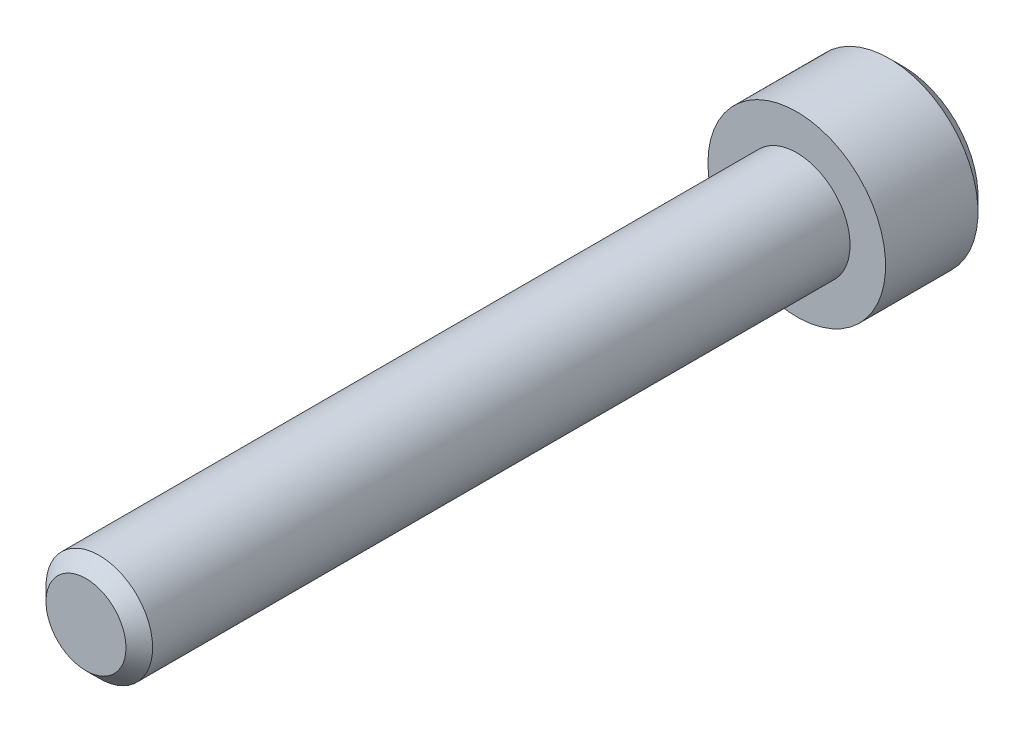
ISO-10303-21;
HEADER;
FILE_DESCRIPTION(('STEP AP214'),'2;1');
FILE_NAME('part.step','',(''),(''),'','','');
FILE_SCHEMA(('AUTOMOTIVE_DESIGN { 1 0 10303 214 1 1 1 1 }'));
ENDSEC;
DATA;
#1=APPLICATION_CONTEXT('core data for automotive mechanical design processes');
#2=APPLICATION_PROTOCOL_DEFINITION('international standard','automotive_design',2000,#1);
#3=PRODUCT_CONTEXT('',#1,'mechanical');
#4=PRODUCT('Part','Part','',(#3));
#5=PRODUCT_RELATED_PRODUCT_CATEGORY('part','',(#4));
#6=PRODUCT_DEFINITION_FORMATION('','',#4);
#7=PRODUCT_DEFINITION_CONTEXT('part definition',#1,'design');
#8=PRODUCT_DEFINITION('design','',#6,#7);
#9=PRODUCT_DEFINITION_SHAPE('','',#8);
#10=(LENGTH_UNIT() NAMED_UNIT(*) SI_UNIT(.MILLI.,.METRE.));
#11=(NAMED_UNIT(*) PLANE_ANGLE_UNIT() SI_UNIT($,.RADIAN.));
#12=(NAMED_UNIT(*) SI_UNIT($,.STERADIAN.) SOLID_ANGLE_UNIT());
#13=UNCERTAINTY_MEASURE_WITH_UNIT(LENGTH_MEASURE(1.E-05),#10,'distance_accuracy_value','');
#14=(GEOMETRIC_REPRESENTATION_CONTEXT(3) GLOBAL_UNCERTAINTY_ASSIGNED_CONTEXT((#13)) GLOBAL_UNIT_ASSIGNED_CONTEXT((#10,
#11,#12)) REPRESENTATION_CONTEXT('',''));
#15=CARTESIAN_POINT('',(0.,0.,0.));
#16=DIRECTION('',(0.,0.,1.));
#17=DIRECTION('',(1.,0.,0.));
#18=AXIS2_PLACEMENT_3D('',#15,#16,#17);
#19=CARTESIAN_POINT('',(10.0000080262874,-60.435,-91.));
#20=DIRECTION('',(0.,0.,-1.));
#21=DIRECTION('',(-1.,0.,0.));
#22=AXIS2_PLACEMENT_3D('',#19,#20,#21);
#23=PLANE('',#22);
#24=DIRECTION('',(-0.5,-0.866025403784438,0.));
#25=VECTOR('',#24,1.);
#26=CARTESIAN_POINT('',(12.8867593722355,-60.435,-91.));
#27=LINE('',#26,#25);
#28=CARTESIAN_POINT('',(12.8867593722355,-60.435,-91.));
#29=VERTEX_POINT('',#28);
#30=CARTESIAN_POINT('',(11.4433836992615,-62.935,-91.));
#31=VERTEX_POINT('',#30);
#32=EDGE_CURVE('E291',#29,#31,#27,.T.);
#33=ORIENTED_EDGE('',*,*,#32,.F.);
#34=DIRECTION('',(0.5,-0.866025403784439,0.));
#35=VECTOR('',#34,1.);
#36=CARTESIAN_POINT('',(11.4433836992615,-57.935,-91.));
#37=LINE('',#36,#35);
#38=CARTESIAN_POINT('',(11.4433836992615,-57.935,-91.));
#39=VERTEX_POINT('',#38);
#40=EDGE_CURVE('E88',#39,#29,#37,.T.);
#41=ORIENTED_EDGE('',*,*,#40,.F.);
#42=DIRECTION('',(1.,0.,0.));
#43=VECTOR('',#42,1.);
#44=CARTESIAN_POINT('',(8.55663235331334,-57.935,-91.));
#45=LINE('',#44,#43);
#46=CARTESIAN_POINT('',(8.55663235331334,-57.935,-91.));
#47=VERTEX_POINT('',#46);
#48=EDGE_CURVE('E31',#47,#39,#45,.T.);
#49=ORIENTED_EDGE('',*,*,#48,.F.);
#50=DIRECTION('',(0.5,0.866025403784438,0.));
#51=VECTOR('',#50,1.);
#52=CARTESIAN_POINT('',(7.11325668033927,-60.435,-91.));
#53=LINE('',#52,#51);
#54=CARTESIAN_POINT('',(7.11325668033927,-60.435,-91.));
#55=VERTEX_POINT('',#54);
#56=EDGE_CURVE('E66',#55,#47,#53,.T.);
#57=ORIENTED_EDGE('',*,*,#56,.F.);
#58=DIRECTION('',(-0.5,0.86602540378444,0.));
#59=VECTOR('',#58,1.);
#60=CARTESIAN_POINT('',(8.55663235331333,-62.935,-91.));
#61=LINE('',#60,#59);
#62=CARTESIAN_POINT('',(8.55663235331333,-62.935,-91.));
#63=VERTEX_POINT('',#62);
#64=EDGE_CURVE('E76',#63,#55,#61,.T.);
#65=ORIENTED_EDGE('',*,*,#64,.F.);
#66=DIRECTION('',(-1.,0.,0.));
#67=VECTOR('',#66,1.);
#68=CARTESIAN_POINT('',(11.4433836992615,-62.935,-91.));
#69=LINE('',#68,#67);
#70=EDGE_CURVE('E82',#31,#63,#69,.T.);
#71=ORIENTED_EDGE('',*,*,#70,.F.);
#72=EDGE_LOOP('',(#33,#41,#49,#57,#65,#71));
#73=FACE_BOUND('',#72,.T.);
#74=CARTESIAN_POINT('',(10.0000080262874,-60.435,-91.));
#75=DIRECTION('',(0.,0.,-1.));
#76=DIRECTION('',(-1.,0.,0.));
#77=AXIS2_PLACEMENT_3D('',#74,#75,#76);
#78=CIRCLE('',#77,4.2);
#79=CARTESIAN_POINT('',(5.8000080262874,-60.435,-91.));
#80=VERTEX_POINT('',#79);
#81=EDGE_CURVE('E110',#80,#80,#78,.T.);
#82=ORIENTED_EDGE('',*,*,#81,.T.);
#83=EDGE_LOOP('',(#82));
#84=FACE_BOUND('',#83,.T.);
#85=ADVANCED_FACE('F16',(#73,#84),#23,.T.);
#86=CARTESIAN_POINT('',(10.0000080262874,-60.435,-85.));
#87=DIRECTION('',(0.,0.,1.));
#88=DIRECTION('',(1.,0.,0.));
#89=AXIS2_PLACEMENT_3D('',#86,#87,#88);
#90=PLANE('',#89);
#91=CARTESIAN_POINT('',(10.0000080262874,-60.435,-85.));
#92=DIRECTION('',(0.,0.,1.));
#93=DIRECTION('',(1.,0.,0.));
#94=AXIS2_PLACEMENT_3D('',#91,#92,#93);
#95=CIRCLE('',#94,3.);
#96=CARTESIAN_POINT('',(13.0000080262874,-60.435,-85.));
#97=VERTEX_POINT('',#96);
#98=EDGE_CURVE('E113',#97,#97,#95,.T.);
#99=ORIENTED_EDGE('',*,*,#98,.F.);
#100=EDGE_LOOP('',(#99));
#101=FACE_BOUND('',#100,.T.);
#102=CARTESIAN_POINT('',(10.0000080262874,-60.435,-85.));
#103=DIRECTION('',(0.,0.,-1.));
#104=DIRECTION('',(-1.,0.,0.));
#105=AXIS2_PLACEMENT_3D('',#102,#103,#104);
#106=CIRCLE('',#105,5.);
#107=CARTESIAN_POINT('',(5.0000080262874,-60.435,-85.));
#108=VERTEX_POINT('',#107);
#109=EDGE_CURVE('E102',#108,#108,#106,.T.);
#110=ORIENTED_EDGE('',*,*,#109,.F.);
#111=EDGE_LOOP('',(#110));
#112=FACE_BOUND('',#111,.T.);
#113=ADVANCED_FACE('F132',(#101,#112),#90,.T.);
#114=CARTESIAN_POINT('',(10.0000080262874,-60.435,-85.));
#115=DIRECTION('',(0.,0.,-1.));
#116=DIRECTION('',(-1.,0.,0.));
#117=AXIS2_PLACEMENT_3D('',#114,#115,#116);
#118=CYLINDRICAL_SURFACE('',#117,5.);
#119=CARTESIAN_POINT('',(10.0000080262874,-60.435,-90.2));
#120=DIRECTION('',(0.,0.,-1.));
#121=DIRECTION('',(-1.,0.,0.));
#122=AXIS2_PLACEMENT_3D('',#119,#120,#121);
#123=CIRCLE('',#122,5.);
#124=CARTESIAN_POINT('',(5.0000080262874,-60.435,-90.2));
#125=VERTEX_POINT('',#124);
#126=EDGE_CURVE('E107',#125,#125,#123,.F.);
#127=ORIENTED_EDGE('',*,*,#126,.T.);
#128=EDGE_LOOP('',(#127));
#129=FACE_BOUND('',#128,.T.);
#130=ORIENTED_EDGE('',*,*,#109,.T.);
#131=EDGE_LOOP('',(#130));
#132=FACE_BOUND('',#131,.T.);
#133=ADVANCED_FACE('F137',(#129,#132),#118,.T.);
#134=CARTESIAN_POINT('',(10.0000080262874,-60.435,-90.2));
#135=DIRECTION('',(0.,0.,1.));
#136=DIRECTION('',(1.,0.,0.));
#137=AXIS2_PLACEMENT_3D('',#134,#135,#136);
#138=CONICAL_SURFACE('',#137,5.,0.785398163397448);
#139=ORIENTED_EDGE('',*,*,#81,.F.);
#140=EDGE_LOOP('',(#139));
#141=FACE_BOUND('',#140,.T.);
#142=ORIENTED_EDGE('',*,*,#126,.F.);
#143=EDGE_LOOP('',(#142));
#144=FACE_BOUND('',#143,.T.);
#145=ADVANCED_FACE('F143',(#141,#144),#138,.T.);
#146=CARTESIAN_POINT('',(12.8867593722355,-60.435,-88.));
#147=DIRECTION('',(0.866025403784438,-0.5,0.));
#148=DIRECTION('',(0.5,0.866025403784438,0.));
#149=AXIS2_PLACEMENT_3D('',#146,#147,#148);
#150=PLANE('',#149);
#151=ORIENTED_EDGE('',*,*,#32,.T.);
#152=DIRECTION('',(0.,0.,-1.));
#153=VECTOR('',#152,1.);
#154=CARTESIAN_POINT('',(11.4433836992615,-62.935,-88.));
#155=LINE('',#154,#153);
#156=CARTESIAN_POINT('',(11.4433836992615,-62.935,-88.));
#157=VERTEX_POINT('',#156);
#158=EDGE_CURVE('E100',#157,#31,#155,.T.);
#159=ORIENTED_EDGE('',*,*,#158,.F.);
#160=DIRECTION('',(-0.5,-0.866025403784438,0.));
#161=VECTOR('',#160,1.);
#162=CARTESIAN_POINT('',(12.8867593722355,-60.435,-88.));
#163=LINE('',#162,#161);
#164=CARTESIAN_POINT('',(12.8867593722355,-60.435,-88.));
#165=VERTEX_POINT('',#164);
#166=EDGE_CURVE('E94',#165,#157,#163,.T.);
#167=ORIENTED_EDGE('',*,*,#166,.F.);
#168=DIRECTION('',(0.,0.,-1.));
#169=VECTOR('',#168,1.);
#170=CARTESIAN_POINT('',(12.8867593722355,-60.435,-88.));
#171=LINE('',#170,#169);
#172=EDGE_CURVE('E97',#165,#29,#171,.T.);
#173=ORIENTED_EDGE('',*,*,#172,.T.);
#174=EDGE_LOOP('',(#151,#159,#167,#173));
#175=FACE_BOUND('',#174,.T.);
#176=ADVANCED_FACE('F146',(#175),#150,.F.);
#177=CARTESIAN_POINT('',(11.4433836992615,-62.935,-88.));
#178=DIRECTION('',(0.,-1.,0.));
#179=DIRECTION('',(1.,0.,0.));
#180=AXIS2_PLACEMENT_3D('',#177,#178,#179);
#181=PLANE('',#180);
#182=ORIENTED_EDGE('',*,*,#70,.T.);
#183=DIRECTION('',(0.,0.,-1.));
#184=VECTOR('',#183,1.);
#185=CARTESIAN_POINT('',(8.55663235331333,-62.935,-88.));
#186=LINE('',#185,#184);
#187=CARTESIAN_POINT('',(8.55663235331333,-62.935,-88.));
#188=VERTEX_POINT('',#187);
#189=EDGE_CURVE('E72',#188,#63,#186,.T.);
#190=ORIENTED_EDGE('',*,*,#189,.F.);
#191=DIRECTION('',(-1.,0.,0.));
#192=VECTOR('',#191,1.);
#193=CARTESIAN_POINT('',(11.4433836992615,-62.935,-88.));
#194=LINE('',#193,#192);
#195=EDGE_CURVE('E288',#157,#188,#194,.T.);
#196=ORIENTED_EDGE('',*,*,#195,.F.);
#197=ORIENTED_EDGE('',*,*,#158,.T.);
#198=EDGE_LOOP('',(#182,#190,#196,#197));
#199=FACE_BOUND('',#198,.T.);
#200=ADVANCED_FACE('F151',(#199),#181,.F.);
#201=CARTESIAN_POINT('',(8.55663235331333,-62.935,-88.));
#202=DIRECTION('',(-0.86602540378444,-0.5,0.));
#203=DIRECTION('',(0.5,-0.86602540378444,0.));
#204=AXIS2_PLACEMENT_3D('',#201,#202,#203);
#205=PLANE('',#204);
#206=ORIENTED_EDGE('',*,*,#64,.T.);
#207=DIRECTION('',(0.,0.,-1.));
#208=VECTOR('',#207,1.);
#209=CARTESIAN_POINT('',(7.11325668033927,-60.435,-88.));
#210=LINE('',#209,#208);
#211=CARTESIAN_POINT('',(7.11325668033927,-60.435,-88.));
#212=VERTEX_POINT('',#211);
#213=EDGE_CURVE('E61',#212,#55,#210,.T.);
#214=ORIENTED_EDGE('',*,*,#213,.F.);
#215=DIRECTION('',(-0.5,0.86602540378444,0.));
#216=VECTOR('',#215,1.);
#217=CARTESIAN_POINT('',(8.55663235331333,-62.935,-88.));
#218=LINE('',#217,#216);
#219=EDGE_CURVE('E294',#188,#212,#218,.T.);
#220=ORIENTED_EDGE('',*,*,#219,.F.);
#221=ORIENTED_EDGE('',*,*,#189,.T.);
#222=EDGE_LOOP('',(#206,#214,#220,#221));
#223=FACE_BOUND('',#222,.T.);
#224=ADVANCED_FACE('F77',(#223),#205,.F.);
#225=CARTESIAN_POINT('',(7.11325668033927,-60.435,-88.));
#226=DIRECTION('',(-0.866025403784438,0.5,0.));
#227=DIRECTION('',(-0.5,-0.866025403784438,0.));
#228=AXIS2_PLACEMENT_3D('',#225,#226,#227);
#229=PLANE('',#228);
#230=ORIENTED_EDGE('',*,*,#56,.T.);
#231=DIRECTION('',(0.,0.,-1.));
#232=VECTOR('',#231,1.);
#233=CARTESIAN_POINT('',(8.55663235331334,-57.935,-88.));
#234=LINE('',#233,#232);
#235=CARTESIAN_POINT('',(8.55663235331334,-57.935,-88.));
#236=VERTEX_POINT('',#235);
#237=EDGE_CURVE('E73',#236,#47,#234,.T.);
#238=ORIENTED_EDGE('',*,*,#237,.F.);
#239=DIRECTION('',(0.5,0.866025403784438,0.));
#240=VECTOR('',#239,1.);
#241=CARTESIAN_POINT('',(7.11325668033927,-60.435,-88.));
#242=LINE('',#241,#240);
#243=EDGE_CURVE('E69',#212,#236,#242,.T.);
#244=ORIENTED_EDGE('',*,*,#243,.F.);
#245=ORIENTED_EDGE('',*,*,#213,.T.);
#246=EDGE_LOOP('',(#230,#238,#244,#245));
#247=FACE_BOUND('',#246,.T.);
#248=ADVANCED_FACE('F63',(#247),#229,.F.);
#249=CARTESIAN_POINT('',(8.55663235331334,-57.935,-88.));
#250=DIRECTION('',(0.,1.,0.));
#251=DIRECTION('',(-1.,0.,0.));
#252=AXIS2_PLACEMENT_3D('',#249,#250,#251);
#253=PLANE('',#252);
#254=ORIENTED_EDGE('',*,*,#48,.T.);
#255=DIRECTION('',(0.,0.,-1.));
#256=VECTOR('',#255,1.);
#257=CARTESIAN_POINT('',(11.4433836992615,-57.935,-88.));
#258=LINE('',#257,#256);
#259=CARTESIAN_POINT('',(11.4433836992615,-57.935,-88.));
#260=VERTEX_POINT('',#259);
#261=EDGE_CURVE('E95',#260,#39,#258,.T.);
#262=ORIENTED_EDGE('',*,*,#261,.F.);
#263=DIRECTION('',(1.,0.,0.));
#264=VECTOR('',#263,1.);
#265=CARTESIAN_POINT('',(8.55663235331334,-57.935,-88.));
#266=LINE('',#265,#264);
#267=EDGE_CURVE('E40',#236,#260,#266,.T.);
#268=ORIENTED_EDGE('',*,*,#267,.F.);
#269=ORIENTED_EDGE('',*,*,#237,.T.);
#270=EDGE_LOOP('',(#254,#262,#268,#269));
#271=FACE_BOUND('',#270,.T.);
#272=ADVANCED_FACE('F170',(#271),#253,.F.);
#273=CARTESIAN_POINT('',(11.4433836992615,-57.935,-88.));
#274=DIRECTION('',(0.866025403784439,0.5,0.));
#275=DIRECTION('',(-0.5,0.866025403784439,0.));
#276=AXIS2_PLACEMENT_3D('',#273,#274,#275);
#277=PLANE('',#276);
#278=ORIENTED_EDGE('',*,*,#40,.T.);
#279=ORIENTED_EDGE('',*,*,#172,.F.);
#280=DIRECTION('',(0.5,-0.866025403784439,0.));
#281=VECTOR('',#280,1.);
#282=CARTESIAN_POINT('',(11.4433836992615,-57.935,-88.));
#283=LINE('',#282,#281);
#284=EDGE_CURVE('E104',#260,#165,#283,.T.);
#285=ORIENTED_EDGE('',*,*,#284,.F.);
#286=ORIENTED_EDGE('',*,*,#261,.T.);
#287=EDGE_LOOP('',(#278,#279,#285,#286));
#288=FACE_BOUND('',#287,.T.);
#289=ADVANCED_FACE('F173',(#288),#277,.F.);
#290=CARTESIAN_POINT('',(12.8867593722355,-60.435,-88.));
#291=DIRECTION('',(0.433012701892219,-0.25,0.866025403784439));
#292=DIRECTION('',(0.894427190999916,0.,-0.447213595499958));
#293=AXIS2_PLACEMENT_3D('',#290,#291,#292);
#294=PLANE('',#293);
#295=ORIENTED_EDGE('',*,*,#166,.T.);
#296=DIRECTION('',(0.447213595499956,-0.774596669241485,-0.447213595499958));
#297=VECTOR('',#296,1.);
#298=CARTESIAN_POINT('',(10.8660334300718,-61.935,-87.4226497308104));
#299=LINE('',#298,#297);
#300=CARTESIAN_POINT('',(10.0000080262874,-60.435,-86.5566243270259));
#301=VERTEX_POINT('',#300);
#302=EDGE_CURVE('E281',#301,#157,#299,.T.);
#303=ORIENTED_EDGE('',*,*,#302,.F.);
#304=DIRECTION('',(0.894427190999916,0.,-0.447213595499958));
#305=VECTOR('',#304,1.);
#306=CARTESIAN_POINT('',(11.7320588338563,-60.435,-87.4226497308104));
#307=LINE('',#306,#305);
#308=EDGE_CURVE('E284',#301,#165,#307,.T.);
#309=ORIENTED_EDGE('',*,*,#308,.T.);
#310=EDGE_LOOP('',(#295,#303,#309));
#311=FACE_BOUND('',#310,.T.);
#312=ADVANCED_FACE('F176',(#311),#294,.F.);
#313=CARTESIAN_POINT('',(11.4433836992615,-62.935,-88.));
#314=DIRECTION('',(0.,-0.5,0.866025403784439));
#315=DIRECTION('',(0.,-0.866025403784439,-0.5));
#316=AXIS2_PLACEMENT_3D('',#313,#314,#315);
#317=PLANE('',#316);
#318=ORIENTED_EDGE('',*,*,#195,.T.);
#319=DIRECTION('',(-0.447213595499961,-0.774596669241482,-0.447213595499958));
#320=VECTOR('',#319,1.);
#321=CARTESIAN_POINT('',(9.13398262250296,-61.935,-87.4226497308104));
#322=LINE('',#321,#320);
#323=EDGE_CURVE('E314',#301,#188,#322,.T.);
#324=ORIENTED_EDGE('',*,*,#323,.F.);
#325=ORIENTED_EDGE('',*,*,#302,.T.);
#326=EDGE_LOOP('',(#318,#324,#325));
#327=FACE_BOUND('',#326,.T.);
#328=ADVANCED_FACE('F192',(#327),#317,.F.);
#329=CARTESIAN_POINT('',(8.55663235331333,-62.935,-88.));
#330=DIRECTION('',(-0.43301270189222,-0.25,0.866025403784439));
#331=DIRECTION('',(0.894427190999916,0.,0.447213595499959));
#332=AXIS2_PLACEMENT_3D('',#329,#330,#331);
#333=PLANE('',#332);
#334=ORIENTED_EDGE('',*,*,#219,.T.);
#335=DIRECTION('',(-0.894427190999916,0.,-0.447213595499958));
#336=VECTOR('',#335,1.);
#337=CARTESIAN_POINT('',(8.26795721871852,-60.435,-87.4226497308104));
#338=LINE('',#337,#336);
#339=EDGE_CURVE('E315',#301,#212,#338,.T.);
#340=ORIENTED_EDGE('',*,*,#339,.F.);
#341=ORIENTED_EDGE('',*,*,#323,.T.);
#342=EDGE_LOOP('',(#334,#340,#341));
#343=FACE_BOUND('',#342,.T.);
#344=ADVANCED_FACE('F188',(#343),#333,.F.);
#345=CARTESIAN_POINT('',(7.11325668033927,-60.435,-88.));
#346=DIRECTION('',(-0.433012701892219,0.25,0.866025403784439));
#347=DIRECTION('',(0.894427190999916,0.,0.447213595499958));
#348=AXIS2_PLACEMENT_3D('',#345,#346,#347);
#349=PLANE('',#348);
#350=ORIENTED_EDGE('',*,*,#243,.T.);
#351=DIRECTION('',(-0.447213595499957,0.774596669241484,-0.447213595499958));
#352=VECTOR('',#351,1.);
#353=CARTESIAN_POINT('',(9.13398262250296,-58.935,-87.4226497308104));
#354=LINE('',#353,#352);
#355=EDGE_CURVE('E308',#301,#236,#354,.T.);
#356=ORIENTED_EDGE('',*,*,#355,.F.);
#357=ORIENTED_EDGE('',*,*,#339,.T.);
#358=EDGE_LOOP('',(#350,#356,#357));
#359=FACE_BOUND('',#358,.T.);
#360=ADVANCED_FACE('F185',(#359),#349,.F.);
#361=CARTESIAN_POINT('',(8.55663235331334,-57.935,-88.));
#362=DIRECTION('',(0.,0.5,0.866025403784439));
#363=DIRECTION('',(0.,-0.866025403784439,0.5));
#364=AXIS2_PLACEMENT_3D('',#361,#362,#363);
#365=PLANE('',#364);
#366=ORIENTED_EDGE('',*,*,#267,.T.);
#367=DIRECTION('',(0.447213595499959,0.774596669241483,-0.447213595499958));
#368=VECTOR('',#367,1.);
#369=CARTESIAN_POINT('',(10.8660334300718,-58.935,-87.4226497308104));
#370=LINE('',#369,#368);
#371=EDGE_CURVE('E321',#301,#260,#370,.T.);
#372=ORIENTED_EDGE('',*,*,#371,.F.);
#373=ORIENTED_EDGE('',*,*,#355,.T.);
#374=EDGE_LOOP('',(#366,#372,#373));
#375=FACE_BOUND('',#374,.T.);
#376=ADVANCED_FACE('F181',(#375),#365,.F.);
#377=CARTESIAN_POINT('',(11.4433836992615,-57.935,-88.));
#378=DIRECTION('',(0.43301270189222,0.25,0.866025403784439));
#379=DIRECTION('',(0.894427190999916,0.,-0.447213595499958));
#380=AXIS2_PLACEMENT_3D('',#377,#378,#379);
#381=PLANE('',#380);
#382=ORIENTED_EDGE('',*,*,#284,.T.);
#383=ORIENTED_EDGE('',*,*,#308,.F.);
#384=ORIENTED_EDGE('',*,*,#371,.T.);
#385=EDGE_LOOP('',(#382,#383,#384));
#386=FACE_BOUND('',#385,.T.);
#387=ADVANCED_FACE('F178',(#386),#381,.F.);
#388=CARTESIAN_POINT('',(10.0000080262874,-60.435,-45.));
#389=DIRECTION('',(0.,0.,-1.));
#390=DIRECTION('',(-1.,0.,0.));
#391=AXIS2_PLACEMENT_3D('',#388,#389,#390);
#392=CYLINDRICAL_SURFACE('',#391,3.);
#393=CARTESIAN_POINT('',(10.0000080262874,-60.435,-45.75));
#394=DIRECTION('',(0.,0.,1.));
#395=DIRECTION('',(1.,0.,0.));
#396=AXIS2_PLACEMENT_3D('',#393,#394,#395);
#397=CIRCLE('',#396,3.);
#398=CARTESIAN_POINT('',(13.0000080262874,-60.435,-45.75));
#399=VERTEX_POINT('',#398);
#400=EDGE_CURVE('E24',#399,#399,#397,.F.);
#401=ORIENTED_EDGE('',*,*,#400,.T.);
#402=EDGE_LOOP('',(#401));
#403=FACE_BOUND('',#402,.T.);
#404=ORIENTED_EDGE('',*,*,#98,.T.);
#405=EDGE_LOOP('',(#404));
#406=FACE_BOUND('',#405,.T.);
#407=ADVANCED_FACE('F118',(#403,#406),#392,.T.);
#408=CARTESIAN_POINT('',(10.0000080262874,-60.435,-45.));
#409=DIRECTION('',(0.,0.,1.));
#410=DIRECTION('',(1.,0.,0.));
#411=AXIS2_PLACEMENT_3D('',#408,#409,#410);
#412=PLANE('',#411);
#413=CARTESIAN_POINT('',(10.0000080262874,-60.435,-45.));
#414=DIRECTION('',(0.,0.,1.));
#415=DIRECTION('',(1.,0.,0.));
#416=AXIS2_PLACEMENT_3D('',#413,#414,#415);
#417=CIRCLE('',#416,2.25);
#418=CARTESIAN_POINT('',(12.2500080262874,-60.435,-45.));
#419=VERTEX_POINT('',#418);
#420=EDGE_CURVE('E11',#419,#419,#417,.T.);
#421=ORIENTED_EDGE('',*,*,#420,.T.);
#422=EDGE_LOOP('',(#421));
#423=FACE_BOUND('',#422,.T.);
#424=ADVANCED_FACE('F122',(#423),#412,.T.);
#425=CARTESIAN_POINT('',(10.0000080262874,-60.435,-45.75));
#426=DIRECTION('',(0.,0.,-1.));
#427=DIRECTION('',(-1.,0.,0.));
#428=AXIS2_PLACEMENT_3D('',#425,#426,#427);
#429=CONICAL_SURFACE('',#428,3.,0.785398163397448);
#430=ORIENTED_EDGE('',*,*,#420,.F.);
#431=EDGE_LOOP('',(#430));
#432=FACE_BOUND('',#431,.T.);
#433=ORIENTED_EDGE('',*,*,#400,.F.);
#434=EDGE_LOOP('',(#433));
#435=FACE_BOUND('',#434,.T.);
#436=ADVANCED_FACE('F18',(#432,#435),#429,.T.);
#437=CLOSED_SHELL('',(#85,#113,#133,#145,#176,#200,#224,#248,#272,#289,#312,#328,#344,#360,#376,
#387,#407,#424,#436));
#438=MANIFOLD_SOLID_BREP('B1',#437);
#439=ADVANCED_BREP_SHAPE_REPRESENTATION('',(#18,#438),#14);
#440=SHAPE_DEFINITION_REPRESENTATION(#9,#439);
ENDSEC;
END-ISO-10303-21;
